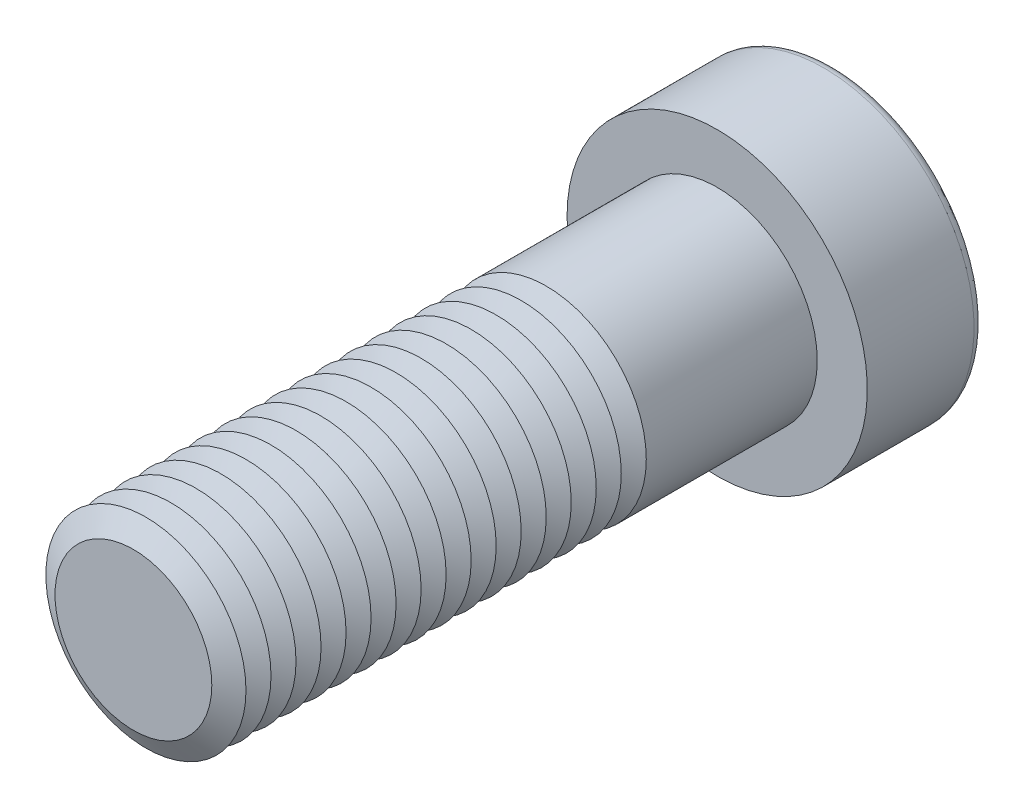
ISO-10303-21;
HEADER;
FILE_DESCRIPTION(('STEP AP214'),'2;1');
FILE_NAME('part.step','',(''),(''),'','','');
FILE_SCHEMA(('AUTOMOTIVE_DESIGN { 1 0 10303 214 1 1 1 1 }'));
ENDSEC;
DATA;
#1=APPLICATION_CONTEXT('core data for automotive mechanical design processes');
#2=APPLICATION_PROTOCOL_DEFINITION('international standard','automotive_design',2000,#1);
#3=PRODUCT_CONTEXT('',#1,'mechanical');
#4=PRODUCT('Part','Part','',(#3));
#5=PRODUCT_RELATED_PRODUCT_CATEGORY('part','',(#4));
#6=PRODUCT_DEFINITION_FORMATION('','',#4);
#7=PRODUCT_DEFINITION_CONTEXT('part definition',#1,'design');
#8=PRODUCT_DEFINITION('design','',#6,#7);
#9=PRODUCT_DEFINITION_SHAPE('','',#8);
#10=(LENGTH_UNIT() NAMED_UNIT(*) SI_UNIT(.MILLI.,.METRE.));
#11=(NAMED_UNIT(*) PLANE_ANGLE_UNIT() SI_UNIT($,.RADIAN.));
#12=(NAMED_UNIT(*) SI_UNIT($,.STERADIAN.) SOLID_ANGLE_UNIT());
#13=UNCERTAINTY_MEASURE_WITH_UNIT(LENGTH_MEASURE(1.E-05),#10,'distance_accuracy_value','');
#14=(GEOMETRIC_REPRESENTATION_CONTEXT(3) GLOBAL_UNCERTAINTY_ASSIGNED_CONTEXT((#13)) GLOBAL_UNIT_ASSIGNED_CONTEXT((#10,
#11,#12)) REPRESENTATION_CONTEXT('',''));
#15=CARTESIAN_POINT('',(0.,0.,0.));
#16=DIRECTION('',(0.,0.,1.));
#17=DIRECTION('',(1.,0.,0.));
#18=AXIS2_PLACEMENT_3D('',#15,#16,#17);
#19=CARTESIAN_POINT('',(0.,0.,59.5));
#20=DIRECTION('',(0.,0.,1.));
#21=DIRECTION('',(1.,0.,0.));
#22=AXIS2_PLACEMENT_3D('',#19,#20,#21);
#23=CONICAL_SURFACE('',#22,12.,1.0471975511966);
#24=CARTESIAN_POINT('',(0.,0.,58.));
#25=DIRECTION('',(0.,0.,1.));
#26=DIRECTION('',(1.,0.,0.));
#27=AXIS2_PLACEMENT_3D('',#24,#25,#26);
#28=CIRCLE('',#27,9.40192378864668);
#29=CARTESIAN_POINT('',(9.40192378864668,0.,58.));
#30=VERTEX_POINT('',#29);
#31=EDGE_CURVE('E314',#30,#30,#28,.T.);
#32=ORIENTED_EDGE('',*,*,#31,.T.);
#33=EDGE_LOOP('',(#32));
#34=FACE_BOUND('',#33,.T.);
#35=CARTESIAN_POINT('',(0.,0.,59.5));
#36=DIRECTION('',(0.,0.,1.));
#37=DIRECTION('',(1.,0.,0.));
#38=AXIS2_PLACEMENT_3D('',#35,#36,#37);
#39=CIRCLE('',#38,12.);
#40=CARTESIAN_POINT('',(12.,0.,59.5));
#41=VERTEX_POINT('',#40);
#42=EDGE_CURVE('E317',#41,#41,#39,.T.);
#43=ORIENTED_EDGE('',*,*,#42,.F.);
#44=EDGE_LOOP('',(#43));
#45=FACE_BOUND('',#44,.T.);
#46=ADVANCED_FACE('F39',(#34,#45),#23,.T.);
#47=CARTESIAN_POINT('',(0.,0.,58.));
#48=DIRECTION('',(0.,0.,-1.));
#49=DIRECTION('',(-1.,0.,0.));
#50=AXIS2_PLACEMENT_3D('',#47,#48,#49);
#51=CONICAL_SURFACE('',#50,9.40192378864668,1.0471975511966);
#52=CARTESIAN_POINT('',(0.,0.,56.5));
#53=DIRECTION('',(0.,0.,1.));
#54=DIRECTION('',(1.,0.,0.));
#55=AXIS2_PLACEMENT_3D('',#52,#53,#54);
#56=CIRCLE('',#55,12.);
#57=CARTESIAN_POINT('',(12.,0.,56.5));
#58=VERTEX_POINT('',#57);
#59=EDGE_CURVE('E325',#58,#58,#56,.T.);
#60=ORIENTED_EDGE('',*,*,#59,.T.);
#61=EDGE_LOOP('',(#60));
#62=FACE_BOUND('',#61,.T.);
#63=ORIENTED_EDGE('',*,*,#31,.F.);
#64=EDGE_LOOP('',(#63));
#65=FACE_BOUND('',#64,.T.);
#66=ADVANCED_FACE('F245',(#62,#65),#51,.T.);
#67=CARTESIAN_POINT('',(0.,0.,70.));
#68=DIRECTION('',(0.,0.,1.));
#69=DIRECTION('',(1.,0.,0.));
#70=AXIS2_PLACEMENT_3D('',#67,#68,#69);
#71=PLANE('',#70);
#72=CARTESIAN_POINT('',(0.,0.,70.));
#73=DIRECTION('',(0.,0.,1.));
#74=DIRECTION('',(1.,0.,0.));
#75=AXIS2_PLACEMENT_3D('',#72,#73,#74);
#76=CIRCLE('',#75,9.40192378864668);
#77=CARTESIAN_POINT('',(9.40192378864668,0.,70.));
#78=VERTEX_POINT('',#77);
#79=EDGE_CURVE('E174',#78,#78,#76,.T.);
#80=ORIENTED_EDGE('',*,*,#79,.T.);
#81=EDGE_LOOP('',(#80));
#82=FACE_BOUND('',#81,.T.);
#83=ADVANCED_FACE('F251',(#82),#71,.T.);
#84=CARTESIAN_POINT('',(0.,0.,70.));
#85=DIRECTION('',(0.,0.,-1.));
#86=DIRECTION('',(-1.,0.,0.));
#87=AXIS2_PLACEMENT_3D('',#84,#85,#86);
#88=CONICAL_SURFACE('',#87,9.40192378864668,1.0471975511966);
#89=CARTESIAN_POINT('',(0.,0.,68.5));
#90=DIRECTION('',(0.,0.,1.));
#91=DIRECTION('',(1.,0.,0.));
#92=AXIS2_PLACEMENT_3D('',#89,#90,#91);
#93=CIRCLE('',#92,12.);
#94=CARTESIAN_POINT('',(12.,0.,68.5));
#95=VERTEX_POINT('',#94);
#96=EDGE_CURVE('E291',#95,#95,#93,.T.);
#97=ORIENTED_EDGE('',*,*,#96,.T.);
#98=EDGE_LOOP('',(#97));
#99=FACE_BOUND('',#98,.T.);
#100=ORIENTED_EDGE('',*,*,#79,.F.);
#101=EDGE_LOOP('',(#100));
#102=FACE_BOUND('',#101,.T.);
#103=ADVANCED_FACE('F199',(#99,#102),#88,.T.);
#104=CARTESIAN_POINT('',(0.,0.,68.5));
#105=DIRECTION('',(0.,0.,1.));
#106=DIRECTION('',(1.,0.,0.));
#107=AXIS2_PLACEMENT_3D('',#104,#105,#106);
#108=CONICAL_SURFACE('',#107,12.,1.0471975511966);
#109=CARTESIAN_POINT('',(0.,0.,67.));
#110=DIRECTION('',(0.,0.,1.));
#111=DIRECTION('',(1.,0.,0.));
#112=AXIS2_PLACEMENT_3D('',#109,#110,#111);
#113=CIRCLE('',#112,9.40192378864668);
#114=CARTESIAN_POINT('',(9.40192378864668,0.,67.));
#115=VERTEX_POINT('',#114);
#116=EDGE_CURVE('E288',#115,#115,#113,.T.);
#117=ORIENTED_EDGE('',*,*,#116,.T.);
#118=EDGE_LOOP('',(#117));
#119=FACE_BOUND('',#118,.T.);
#120=ORIENTED_EDGE('',*,*,#96,.F.);
#121=EDGE_LOOP('',(#120));
#122=FACE_BOUND('',#121,.T.);
#123=ADVANCED_FACE('F277',(#119,#122),#108,.T.);
#124=CARTESIAN_POINT('',(0.,0.,67.));
#125=DIRECTION('',(0.,0.,-1.));
#126=DIRECTION('',(-1.,0.,0.));
#127=AXIS2_PLACEMENT_3D('',#124,#125,#126);
#128=CONICAL_SURFACE('',#127,9.40192378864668,1.0471975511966);
#129=CARTESIAN_POINT('',(0.,0.,65.5));
#130=DIRECTION('',(0.,0.,1.));
#131=DIRECTION('',(1.,0.,0.));
#132=AXIS2_PLACEMENT_3D('',#129,#130,#131);
#133=CIRCLE('',#132,12.);
#134=CARTESIAN_POINT('',(12.,0.,65.5));
#135=VERTEX_POINT('',#134);
#136=EDGE_CURVE('E300',#135,#135,#133,.T.);
#137=ORIENTED_EDGE('',*,*,#136,.T.);
#138=EDGE_LOOP('',(#137));
#139=FACE_BOUND('',#138,.T.);
#140=ORIENTED_EDGE('',*,*,#116,.F.);
#141=EDGE_LOOP('',(#140));
#142=FACE_BOUND('',#141,.T.);
#143=ADVANCED_FACE('F274',(#139,#142),#128,.T.);
#144=CARTESIAN_POINT('',(0.,0.,65.5));
#145=DIRECTION('',(0.,0.,1.));
#146=DIRECTION('',(1.,0.,0.));
#147=AXIS2_PLACEMENT_3D('',#144,#145,#146);
#148=CONICAL_SURFACE('',#147,12.,1.0471975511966);
#149=CARTESIAN_POINT('',(0.,0.,64.));
#150=DIRECTION('',(0.,0.,1.));
#151=DIRECTION('',(1.,0.,0.));
#152=AXIS2_PLACEMENT_3D('',#149,#150,#151);
#153=CIRCLE('',#152,9.40192378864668);
#154=CARTESIAN_POINT('',(9.40192378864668,0.,64.));
#155=VERTEX_POINT('',#154);
#156=EDGE_CURVE('E293',#155,#155,#153,.T.);
#157=ORIENTED_EDGE('',*,*,#156,.T.);
#158=EDGE_LOOP('',(#157));
#159=FACE_BOUND('',#158,.T.);
#160=ORIENTED_EDGE('',*,*,#136,.F.);
#161=EDGE_LOOP('',(#160));
#162=FACE_BOUND('',#161,.T.);
#163=ADVANCED_FACE('F270',(#159,#162),#148,.T.);
#164=CARTESIAN_POINT('',(0.,0.,64.));
#165=DIRECTION('',(0.,0.,-1.));
#166=DIRECTION('',(-1.,0.,0.));
#167=AXIS2_PLACEMENT_3D('',#164,#165,#166);
#168=CONICAL_SURFACE('',#167,9.40192378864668,1.0471975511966);
#169=CARTESIAN_POINT('',(0.,0.,62.5));
#170=DIRECTION('',(0.,0.,1.));
#171=DIRECTION('',(1.,0.,0.));
#172=AXIS2_PLACEMENT_3D('',#169,#170,#171);
#173=CIRCLE('',#172,12.);
#174=CARTESIAN_POINT('',(12.,0.,62.5));
#175=VERTEX_POINT('',#174);
#176=EDGE_CURVE('E310',#175,#175,#173,.T.);
#177=ORIENTED_EDGE('',*,*,#176,.T.);
#178=EDGE_LOOP('',(#177));
#179=FACE_BOUND('',#178,.T.);
#180=ORIENTED_EDGE('',*,*,#156,.F.);
#181=EDGE_LOOP('',(#180));
#182=FACE_BOUND('',#181,.T.);
#183=ADVANCED_FACE('F266',(#179,#182),#168,.T.);
#184=CARTESIAN_POINT('',(0.,0.,62.5));
#185=DIRECTION('',(0.,0.,1.));
#186=DIRECTION('',(1.,0.,0.));
#187=AXIS2_PLACEMENT_3D('',#184,#185,#186);
#188=CONICAL_SURFACE('',#187,12.,1.0471975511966);
#189=CARTESIAN_POINT('',(0.,0.,61.));
#190=DIRECTION('',(0.,0.,1.));
#191=DIRECTION('',(1.,0.,0.));
#192=AXIS2_PLACEMENT_3D('',#189,#190,#191);
#193=CIRCLE('',#192,9.40192378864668);
#194=CARTESIAN_POINT('',(9.40192378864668,0.,61.));
#195=VERTEX_POINT('',#194);
#196=EDGE_CURVE('E306',#195,#195,#193,.T.);
#197=ORIENTED_EDGE('',*,*,#196,.T.);
#198=EDGE_LOOP('',(#197));
#199=FACE_BOUND('',#198,.T.);
#200=ORIENTED_EDGE('',*,*,#176,.F.);
#201=EDGE_LOOP('',(#200));
#202=FACE_BOUND('',#201,.T.);
#203=ADVANCED_FACE('F262',(#199,#202),#188,.T.);
#204=CARTESIAN_POINT('',(0.,0.,61.));
#205=DIRECTION('',(0.,0.,-1.));
#206=DIRECTION('',(-1.,0.,0.));
#207=AXIS2_PLACEMENT_3D('',#204,#205,#206);
#208=CONICAL_SURFACE('',#207,9.40192378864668,1.0471975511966);
#209=ORIENTED_EDGE('',*,*,#42,.T.);
#210=EDGE_LOOP('',(#209));
#211=FACE_BOUND('',#210,.T.);
#212=ORIENTED_EDGE('',*,*,#196,.F.);
#213=EDGE_LOOP('',(#212));
#214=FACE_BOUND('',#213,.T.);
#215=ADVANCED_FACE('F258',(#211,#214),#208,.T.);
#216=CARTESIAN_POINT('',(0.,0.,56.5));
#217=DIRECTION('',(0.,0.,1.));
#218=DIRECTION('',(1.,0.,0.));
#219=AXIS2_PLACEMENT_3D('',#216,#217,#218);
#220=CONICAL_SURFACE('',#219,12.,1.0471975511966);
#221=CARTESIAN_POINT('',(0.,0.,55.));
#222=DIRECTION('',(0.,0.,1.));
#223=DIRECTION('',(1.,0.,0.));
#224=AXIS2_PLACEMENT_3D('',#221,#222,#223);
#225=CIRCLE('',#224,9.40192378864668);
#226=CARTESIAN_POINT('',(9.40192378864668,0.,55.));
#227=VERTEX_POINT('',#226);
#228=EDGE_CURVE('E321',#227,#227,#225,.T.);
#229=ORIENTED_EDGE('',*,*,#228,.T.);
#230=EDGE_LOOP('',(#229));
#231=FACE_BOUND('',#230,.T.);
#232=ORIENTED_EDGE('',*,*,#59,.F.);
#233=EDGE_LOOP('',(#232));
#234=FACE_BOUND('',#233,.T.);
#235=ADVANCED_FACE('F261',(#231,#234),#220,.T.);
#236=CARTESIAN_POINT('',(0.,0.,55.));
#237=DIRECTION('',(0.,0.,-1.));
#238=DIRECTION('',(-1.,0.,0.));
#239=AXIS2_PLACEMENT_3D('',#236,#237,#238);
#240=CONICAL_SURFACE('',#239,9.40192378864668,1.0471975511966);
#241=CARTESIAN_POINT('',(0.,0.,53.5));
#242=DIRECTION('',(0.,0.,1.));
#243=DIRECTION('',(1.,0.,0.));
#244=AXIS2_PLACEMENT_3D('',#241,#242,#243);
#245=CIRCLE('',#244,12.);
#246=CARTESIAN_POINT('',(12.,0.,53.5));
#247=VERTEX_POINT('',#246);
#248=EDGE_CURVE('E332',#247,#247,#245,.T.);
#249=ORIENTED_EDGE('',*,*,#248,.T.);
#250=EDGE_LOOP('',(#249));
#251=FACE_BOUND('',#250,.T.);
#252=ORIENTED_EDGE('',*,*,#228,.F.);
#253=EDGE_LOOP('',(#252));
#254=FACE_BOUND('',#253,.T.);
#255=ADVANCED_FACE('F512',(#251,#254),#240,.T.);
#256=CARTESIAN_POINT('',(0.,0.,53.5));
#257=DIRECTION('',(0.,0.,1.));
#258=DIRECTION('',(1.,0.,0.));
#259=AXIS2_PLACEMENT_3D('',#256,#257,#258);
#260=CONICAL_SURFACE('',#259,12.,1.0471975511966);
#261=CARTESIAN_POINT('',(0.,0.,52.));
#262=DIRECTION('',(0.,0.,1.));
#263=DIRECTION('',(1.,0.,0.));
#264=AXIS2_PLACEMENT_3D('',#261,#262,#263);
#265=CIRCLE('',#264,9.40192378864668);
#266=CARTESIAN_POINT('',(9.40192378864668,0.,52.));
#267=VERTEX_POINT('',#266);
#268=EDGE_CURVE('E329',#267,#267,#265,.T.);
#269=ORIENTED_EDGE('',*,*,#268,.T.);
#270=EDGE_LOOP('',(#269));
#271=FACE_BOUND('',#270,.T.);
#272=ORIENTED_EDGE('',*,*,#248,.F.);
#273=EDGE_LOOP('',(#272));
#274=FACE_BOUND('',#273,.T.);
#275=ADVANCED_FACE('F508',(#271,#274),#260,.T.);
#276=CARTESIAN_POINT('',(0.,0.,52.));
#277=DIRECTION('',(0.,0.,-1.));
#278=DIRECTION('',(-1.,0.,0.));
#279=AXIS2_PLACEMENT_3D('',#276,#277,#278);
#280=CONICAL_SURFACE('',#279,9.40192378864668,1.0471975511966);
#281=CARTESIAN_POINT('',(0.,0.,50.5));
#282=DIRECTION('',(0.,0.,1.));
#283=DIRECTION('',(1.,0.,0.));
#284=AXIS2_PLACEMENT_3D('',#281,#282,#283);
#285=CIRCLE('',#284,12.);
#286=CARTESIAN_POINT('',(12.,0.,50.5));
#287=VERTEX_POINT('',#286);
#288=EDGE_CURVE('E340',#287,#287,#285,.T.);
#289=ORIENTED_EDGE('',*,*,#288,.T.);
#290=EDGE_LOOP('',(#289));
#291=FACE_BOUND('',#290,.T.);
#292=ORIENTED_EDGE('',*,*,#268,.F.);
#293=EDGE_LOOP('',(#292));
#294=FACE_BOUND('',#293,.T.);
#295=ADVANCED_FACE('F504',(#291,#294),#280,.T.);
#296=CARTESIAN_POINT('',(0.,0.,50.5));
#297=DIRECTION('',(0.,0.,1.));
#298=DIRECTION('',(1.,0.,0.));
#299=AXIS2_PLACEMENT_3D('',#296,#297,#298);
#300=CONICAL_SURFACE('',#299,12.,1.0471975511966);
#301=CARTESIAN_POINT('',(0.,0.,49.));
#302=DIRECTION('',(0.,0.,1.));
#303=DIRECTION('',(1.,0.,0.));
#304=AXIS2_PLACEMENT_3D('',#301,#302,#303);
#305=CIRCLE('',#304,9.40192378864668);
#306=CARTESIAN_POINT('',(9.40192378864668,0.,49.));
#307=VERTEX_POINT('',#306);
#308=EDGE_CURVE('E336',#307,#307,#305,.T.);
#309=ORIENTED_EDGE('',*,*,#308,.T.);
#310=EDGE_LOOP('',(#309));
#311=FACE_BOUND('',#310,.T.);
#312=ORIENTED_EDGE('',*,*,#288,.F.);
#313=EDGE_LOOP('',(#312));
#314=FACE_BOUND('',#313,.T.);
#315=ADVANCED_FACE('F500',(#311,#314),#300,.T.);
#316=CARTESIAN_POINT('',(0.,0.,49.));
#317=DIRECTION('',(0.,0.,-1.));
#318=DIRECTION('',(-1.,0.,0.));
#319=AXIS2_PLACEMENT_3D('',#316,#317,#318);
#320=CONICAL_SURFACE('',#319,9.40192378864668,1.0471975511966);
#321=CARTESIAN_POINT('',(0.,0.,47.5));
#322=DIRECTION('',(0.,0.,1.));
#323=DIRECTION('',(1.,0.,0.));
#324=AXIS2_PLACEMENT_3D('',#321,#322,#323);
#325=CIRCLE('',#324,12.);
#326=CARTESIAN_POINT('',(12.,0.,47.5));
#327=VERTEX_POINT('',#326);
#328=EDGE_CURVE('E347',#327,#327,#325,.T.);
#329=ORIENTED_EDGE('',*,*,#328,.T.);
#330=EDGE_LOOP('',(#329));
#331=FACE_BOUND('',#330,.T.);
#332=ORIENTED_EDGE('',*,*,#308,.F.);
#333=EDGE_LOOP('',(#332));
#334=FACE_BOUND('',#333,.T.);
#335=ADVANCED_FACE('F496',(#331,#334),#320,.T.);
#336=CARTESIAN_POINT('',(0.,0.,47.5));
#337=DIRECTION('',(0.,0.,1.));
#338=DIRECTION('',(1.,0.,0.));
#339=AXIS2_PLACEMENT_3D('',#336,#337,#338);
#340=CONICAL_SURFACE('',#339,12.,1.0471975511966);
#341=CARTESIAN_POINT('',(0.,0.,46.));
#342=DIRECTION('',(0.,0.,1.));
#343=DIRECTION('',(1.,0.,0.));
#344=AXIS2_PLACEMENT_3D('',#341,#342,#343);
#345=CIRCLE('',#344,9.40192378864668);
#346=CARTESIAN_POINT('',(9.40192378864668,0.,46.));
#347=VERTEX_POINT('',#346);
#348=EDGE_CURVE('E344',#347,#347,#345,.T.);
#349=ORIENTED_EDGE('',*,*,#348,.T.);
#350=EDGE_LOOP('',(#349));
#351=FACE_BOUND('',#350,.T.);
#352=ORIENTED_EDGE('',*,*,#328,.F.);
#353=EDGE_LOOP('',(#352));
#354=FACE_BOUND('',#353,.T.);
#355=ADVANCED_FACE('F492',(#351,#354),#340,.T.);
#356=CARTESIAN_POINT('',(0.,0.,46.));
#357=DIRECTION('',(0.,0.,-1.));
#358=DIRECTION('',(-1.,0.,0.));
#359=AXIS2_PLACEMENT_3D('',#356,#357,#358);
#360=CONICAL_SURFACE('',#359,9.40192378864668,1.0471975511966);
#361=CARTESIAN_POINT('',(0.,0.,44.5));
#362=DIRECTION('',(0.,0.,1.));
#363=DIRECTION('',(1.,0.,0.));
#364=AXIS2_PLACEMENT_3D('',#361,#362,#363);
#365=CIRCLE('',#364,12.);
#366=CARTESIAN_POINT('',(12.,0.,44.5));
#367=VERTEX_POINT('',#366);
#368=EDGE_CURVE('E355',#367,#367,#365,.T.);
#369=ORIENTED_EDGE('',*,*,#368,.T.);
#370=EDGE_LOOP('',(#369));
#371=FACE_BOUND('',#370,.T.);
#372=ORIENTED_EDGE('',*,*,#348,.F.);
#373=EDGE_LOOP('',(#372));
#374=FACE_BOUND('',#373,.T.);
#375=ADVANCED_FACE('F488',(#371,#374),#360,.T.);
#376=CARTESIAN_POINT('',(0.,0.,44.5));
#377=DIRECTION('',(0.,0.,1.));
#378=DIRECTION('',(1.,0.,0.));
#379=AXIS2_PLACEMENT_3D('',#376,#377,#378);
#380=CONICAL_SURFACE('',#379,12.,1.0471975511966);
#381=CARTESIAN_POINT('',(0.,0.,43.));
#382=DIRECTION('',(0.,0.,1.));
#383=DIRECTION('',(1.,0.,0.));
#384=AXIS2_PLACEMENT_3D('',#381,#382,#383);
#385=CIRCLE('',#384,9.40192378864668);
#386=CARTESIAN_POINT('',(9.40192378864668,0.,43.));
#387=VERTEX_POINT('',#386);
#388=EDGE_CURVE('E351',#387,#387,#385,.T.);
#389=ORIENTED_EDGE('',*,*,#388,.T.);
#390=EDGE_LOOP('',(#389));
#391=FACE_BOUND('',#390,.T.);
#392=ORIENTED_EDGE('',*,*,#368,.F.);
#393=EDGE_LOOP('',(#392));
#394=FACE_BOUND('',#393,.T.);
#395=ADVANCED_FACE('F484',(#391,#394),#380,.T.);
#396=CARTESIAN_POINT('',(0.,0.,43.));
#397=DIRECTION('',(0.,0.,-1.));
#398=DIRECTION('',(-1.,0.,0.));
#399=AXIS2_PLACEMENT_3D('',#396,#397,#398);
#400=CONICAL_SURFACE('',#399,9.40192378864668,1.0471975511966);
#401=CARTESIAN_POINT('',(0.,0.,41.5));
#402=DIRECTION('',(0.,0.,1.));
#403=DIRECTION('',(1.,0.,0.));
#404=AXIS2_PLACEMENT_3D('',#401,#402,#403);
#405=CIRCLE('',#404,12.);
#406=CARTESIAN_POINT('',(12.,0.,41.5));
#407=VERTEX_POINT('',#406);
#408=EDGE_CURVE('E363',#407,#407,#405,.T.);
#409=ORIENTED_EDGE('',*,*,#408,.T.);
#410=EDGE_LOOP('',(#409));
#411=FACE_BOUND('',#410,.T.);
#412=ORIENTED_EDGE('',*,*,#388,.F.);
#413=EDGE_LOOP('',(#412));
#414=FACE_BOUND('',#413,.T.);
#415=ADVANCED_FACE('F480',(#411,#414),#400,.T.);
#416=CARTESIAN_POINT('',(0.,0.,41.5));
#417=DIRECTION('',(0.,0.,1.));
#418=DIRECTION('',(1.,0.,0.));
#419=AXIS2_PLACEMENT_3D('',#416,#417,#418);
#420=CONICAL_SURFACE('',#419,12.,1.0471975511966);
#421=CARTESIAN_POINT('',(0.,0.,40.));
#422=DIRECTION('',(0.,0.,1.));
#423=DIRECTION('',(1.,0.,0.));
#424=AXIS2_PLACEMENT_3D('',#421,#422,#423);
#425=CIRCLE('',#424,9.40192378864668);
#426=CARTESIAN_POINT('',(9.40192378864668,0.,40.));
#427=VERTEX_POINT('',#426);
#428=EDGE_CURVE('E359',#427,#427,#425,.T.);
#429=ORIENTED_EDGE('',*,*,#428,.T.);
#430=EDGE_LOOP('',(#429));
#431=FACE_BOUND('',#430,.T.);
#432=ORIENTED_EDGE('',*,*,#408,.F.);
#433=EDGE_LOOP('',(#432));
#434=FACE_BOUND('',#433,.T.);
#435=ADVANCED_FACE('F476',(#431,#434),#420,.T.);
#436=CARTESIAN_POINT('',(0.,0.,40.));
#437=DIRECTION('',(0.,0.,-1.));
#438=DIRECTION('',(-1.,0.,0.));
#439=AXIS2_PLACEMENT_3D('',#436,#437,#438);
#440=CONICAL_SURFACE('',#439,9.40192378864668,1.0471975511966);
#441=CARTESIAN_POINT('',(0.,0.,38.5));
#442=DIRECTION('',(0.,0.,1.));
#443=DIRECTION('',(1.,0.,0.));
#444=AXIS2_PLACEMENT_3D('',#441,#442,#443);
#445=CIRCLE('',#444,12.);
#446=CARTESIAN_POINT('',(12.,0.,38.5));
#447=VERTEX_POINT('',#446);
#448=EDGE_CURVE('E371',#447,#447,#445,.T.);
#449=ORIENTED_EDGE('',*,*,#448,.T.);
#450=EDGE_LOOP('',(#449));
#451=FACE_BOUND('',#450,.T.);
#452=ORIENTED_EDGE('',*,*,#428,.F.);
#453=EDGE_LOOP('',(#452));
#454=FACE_BOUND('',#453,.T.);
#455=ADVANCED_FACE('F472',(#451,#454),#440,.T.);
#456=CARTESIAN_POINT('',(0.,0.,38.5));
#457=DIRECTION('',(0.,0.,1.));
#458=DIRECTION('',(1.,0.,0.));
#459=AXIS2_PLACEMENT_3D('',#456,#457,#458);
#460=CONICAL_SURFACE('',#459,12.,1.0471975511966);
#461=CARTESIAN_POINT('',(0.,0.,37.));
#462=DIRECTION('',(0.,0.,1.));
#463=DIRECTION('',(1.,0.,0.));
#464=AXIS2_PLACEMENT_3D('',#461,#462,#463);
#465=CIRCLE('',#464,9.40192378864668);
#466=CARTESIAN_POINT('',(9.40192378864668,0.,37.));
#467=VERTEX_POINT('',#466);
#468=EDGE_CURVE('E367',#467,#467,#465,.T.);
#469=ORIENTED_EDGE('',*,*,#468,.T.);
#470=EDGE_LOOP('',(#469));
#471=FACE_BOUND('',#470,.T.);
#472=ORIENTED_EDGE('',*,*,#448,.F.);
#473=EDGE_LOOP('',(#472));
#474=FACE_BOUND('',#473,.T.);
#475=ADVANCED_FACE('F468',(#471,#474),#460,.T.);
#476=CARTESIAN_POINT('',(0.,0.,37.));
#477=DIRECTION('',(0.,0.,-1.));
#478=DIRECTION('',(-1.,0.,0.));
#479=AXIS2_PLACEMENT_3D('',#476,#477,#478);
#480=CONICAL_SURFACE('',#479,9.40192378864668,1.0471975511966);
#481=CARTESIAN_POINT('',(0.,0.,35.5));
#482=DIRECTION('',(0.,0.,1.));
#483=DIRECTION('',(1.,0.,0.));
#484=AXIS2_PLACEMENT_3D('',#481,#482,#483);
#485=CIRCLE('',#484,12.);
#486=CARTESIAN_POINT('',(12.,0.,35.5));
#487=VERTEX_POINT('',#486);
#488=EDGE_CURVE('E379',#487,#487,#485,.T.);
#489=ORIENTED_EDGE('',*,*,#488,.T.);
#490=EDGE_LOOP('',(#489));
#491=FACE_BOUND('',#490,.T.);
#492=ORIENTED_EDGE('',*,*,#468,.F.);
#493=EDGE_LOOP('',(#492));
#494=FACE_BOUND('',#493,.T.);
#495=ADVANCED_FACE('F464',(#491,#494),#480,.T.);
#496=CARTESIAN_POINT('',(0.,0.,35.5));
#497=DIRECTION('',(0.,0.,1.));
#498=DIRECTION('',(1.,0.,0.));
#499=AXIS2_PLACEMENT_3D('',#496,#497,#498);
#500=CONICAL_SURFACE('',#499,12.,1.0471975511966);
#501=CARTESIAN_POINT('',(0.,0.,34.));
#502=DIRECTION('',(0.,0.,1.));
#503=DIRECTION('',(1.,0.,0.));
#504=AXIS2_PLACEMENT_3D('',#501,#502,#503);
#505=CIRCLE('',#504,9.40192378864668);
#506=CARTESIAN_POINT('',(9.40192378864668,0.,34.));
#507=VERTEX_POINT('',#506);
#508=EDGE_CURVE('E375',#507,#507,#505,.T.);
#509=ORIENTED_EDGE('',*,*,#508,.T.);
#510=EDGE_LOOP('',(#509));
#511=FACE_BOUND('',#510,.T.);
#512=ORIENTED_EDGE('',*,*,#488,.F.);
#513=EDGE_LOOP('',(#512));
#514=FACE_BOUND('',#513,.T.);
#515=ADVANCED_FACE('F460',(#511,#514),#500,.T.);
#516=CARTESIAN_POINT('',(0.,0.,34.));
#517=DIRECTION('',(0.,0.,-1.));
#518=DIRECTION('',(-1.,0.,0.));
#519=AXIS2_PLACEMENT_3D('',#516,#517,#518);
#520=CONICAL_SURFACE('',#519,9.40192378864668,1.0471975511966);
#521=CARTESIAN_POINT('',(0.,0.,32.5));
#522=DIRECTION('',(0.,0.,1.));
#523=DIRECTION('',(1.,0.,0.));
#524=AXIS2_PLACEMENT_3D('',#521,#522,#523);
#525=CIRCLE('',#524,12.);
#526=CARTESIAN_POINT('',(12.,0.,32.5));
#527=VERTEX_POINT('',#526);
#528=EDGE_CURVE('E387',#527,#527,#525,.T.);
#529=ORIENTED_EDGE('',*,*,#528,.T.);
#530=EDGE_LOOP('',(#529));
#531=FACE_BOUND('',#530,.T.);
#532=ORIENTED_EDGE('',*,*,#508,.F.);
#533=EDGE_LOOP('',(#532));
#534=FACE_BOUND('',#533,.T.);
#535=ADVANCED_FACE('F456',(#531,#534),#520,.T.);
#536=CARTESIAN_POINT('',(0.,0.,32.5));
#537=DIRECTION('',(0.,0.,1.));
#538=DIRECTION('',(1.,0.,0.));
#539=AXIS2_PLACEMENT_3D('',#536,#537,#538);
#540=CONICAL_SURFACE('',#539,12.,1.0471975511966);
#541=CARTESIAN_POINT('',(0.,0.,31.));
#542=DIRECTION('',(0.,0.,1.));
#543=DIRECTION('',(1.,0.,0.));
#544=AXIS2_PLACEMENT_3D('',#541,#542,#543);
#545=CIRCLE('',#544,9.40192378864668);
#546=CARTESIAN_POINT('',(9.40192378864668,0.,31.));
#547=VERTEX_POINT('',#546);
#548=EDGE_CURVE('E383',#547,#547,#545,.T.);
#549=ORIENTED_EDGE('',*,*,#548,.T.);
#550=EDGE_LOOP('',(#549));
#551=FACE_BOUND('',#550,.T.);
#552=ORIENTED_EDGE('',*,*,#528,.F.);
#553=EDGE_LOOP('',(#552));
#554=FACE_BOUND('',#553,.T.);
#555=ADVANCED_FACE('F452',(#551,#554),#540,.T.);
#556=CARTESIAN_POINT('',(0.,0.,31.));
#557=DIRECTION('',(0.,0.,-1.));
#558=DIRECTION('',(-1.,0.,0.));
#559=AXIS2_PLACEMENT_3D('',#556,#557,#558);
#560=CONICAL_SURFACE('',#559,9.40192378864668,1.0471975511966);
#561=CARTESIAN_POINT('',(0.,0.,29.5));
#562=DIRECTION('',(0.,0.,1.));
#563=DIRECTION('',(1.,0.,0.));
#564=AXIS2_PLACEMENT_3D('',#561,#562,#563);
#565=CIRCLE('',#564,12.);
#566=CARTESIAN_POINT('',(12.,0.,29.5));
#567=VERTEX_POINT('',#566);
#568=EDGE_CURVE('E395',#567,#567,#565,.T.);
#569=ORIENTED_EDGE('',*,*,#568,.T.);
#570=EDGE_LOOP('',(#569));
#571=FACE_BOUND('',#570,.T.);
#572=ORIENTED_EDGE('',*,*,#548,.F.);
#573=EDGE_LOOP('',(#572));
#574=FACE_BOUND('',#573,.T.);
#575=ADVANCED_FACE('F448',(#571,#574),#560,.T.);
#576=CARTESIAN_POINT('',(0.,0.,29.5));
#577=DIRECTION('',(0.,0.,1.));
#578=DIRECTION('',(1.,0.,0.));
#579=AXIS2_PLACEMENT_3D('',#576,#577,#578);
#580=CONICAL_SURFACE('',#579,12.,1.0471975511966);
#581=CARTESIAN_POINT('',(0.,0.,28.));
#582=DIRECTION('',(0.,0.,1.));
#583=DIRECTION('',(1.,0.,0.));
#584=AXIS2_PLACEMENT_3D('',#581,#582,#583);
#585=CIRCLE('',#584,9.40192378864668);
#586=CARTESIAN_POINT('',(9.40192378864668,0.,28.));
#587=VERTEX_POINT('',#586);
#588=EDGE_CURVE('E391',#587,#587,#585,.T.);
#589=ORIENTED_EDGE('',*,*,#588,.T.);
#590=EDGE_LOOP('',(#589));
#591=FACE_BOUND('',#590,.T.);
#592=ORIENTED_EDGE('',*,*,#568,.F.);
#593=EDGE_LOOP('',(#592));
#594=FACE_BOUND('',#593,.T.);
#595=ADVANCED_FACE('F444',(#591,#594),#580,.T.);
#596=CARTESIAN_POINT('',(0.,0.,28.));
#597=DIRECTION('',(0.,0.,-1.));
#598=DIRECTION('',(-1.,0.,0.));
#599=AXIS2_PLACEMENT_3D('',#596,#597,#598);
#600=CONICAL_SURFACE('',#599,9.40192378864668,1.0471975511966);
#601=CARTESIAN_POINT('',(0.,0.,26.5));
#602=DIRECTION('',(0.,0.,1.));
#603=DIRECTION('',(1.,0.,0.));
#604=AXIS2_PLACEMENT_3D('',#601,#602,#603);
#605=CIRCLE('',#604,12.);
#606=CARTESIAN_POINT('',(12.,0.,26.5));
#607=VERTEX_POINT('',#606);
#608=EDGE_CURVE('E403',#607,#607,#605,.T.);
#609=ORIENTED_EDGE('',*,*,#608,.T.);
#610=EDGE_LOOP('',(#609));
#611=FACE_BOUND('',#610,.T.);
#612=ORIENTED_EDGE('',*,*,#588,.F.);
#613=EDGE_LOOP('',(#612));
#614=FACE_BOUND('',#613,.T.);
#615=ADVANCED_FACE('F440',(#611,#614),#600,.T.);
#616=CARTESIAN_POINT('',(0.,0.,26.5));
#617=DIRECTION('',(0.,0.,1.));
#618=DIRECTION('',(1.,0.,0.));
#619=AXIS2_PLACEMENT_3D('',#616,#617,#618);
#620=CONICAL_SURFACE('',#619,12.,1.0471975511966);
#621=CARTESIAN_POINT('',(0.,0.,25.));
#622=DIRECTION('',(0.,0.,1.));
#623=DIRECTION('',(1.,0.,0.));
#624=AXIS2_PLACEMENT_3D('',#621,#622,#623);
#625=CIRCLE('',#624,9.40192378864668);
#626=CARTESIAN_POINT('',(9.40192378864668,0.,25.));
#627=VERTEX_POINT('',#626);
#628=EDGE_CURVE('E399',#627,#627,#625,.T.);
#629=ORIENTED_EDGE('',*,*,#628,.T.);
#630=EDGE_LOOP('',(#629));
#631=FACE_BOUND('',#630,.T.);
#632=ORIENTED_EDGE('',*,*,#608,.F.);
#633=EDGE_LOOP('',(#632));
#634=FACE_BOUND('',#633,.T.);
#635=ADVANCED_FACE('F435',(#631,#634),#620,.T.);
#636=CARTESIAN_POINT('',(0.,0.,25.));
#637=DIRECTION('',(0.,0.,-1.));
#638=DIRECTION('',(-1.,0.,0.));
#639=AXIS2_PLACEMENT_3D('',#636,#637,#638);
#640=CONICAL_SURFACE('',#639,9.40192378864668,1.0471975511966);
#641=CARTESIAN_POINT('',(0.,0.,23.5));
#642=DIRECTION('',(0.,0.,1.));
#643=DIRECTION('',(1.,0.,0.));
#644=AXIS2_PLACEMENT_3D('',#641,#642,#643);
#645=CIRCLE('',#644,12.);
#646=CARTESIAN_POINT('',(12.,0.,23.5));
#647=VERTEX_POINT('',#646);
#648=EDGE_CURVE('E415',#647,#647,#645,.T.);
#649=ORIENTED_EDGE('',*,*,#648,.T.);
#650=EDGE_LOOP('',(#649));
#651=FACE_BOUND('',#650,.T.);
#652=ORIENTED_EDGE('',*,*,#628,.F.);
#653=EDGE_LOOP('',(#652));
#654=FACE_BOUND('',#653,.T.);
#655=ADVANCED_FACE('F421',(#651,#654),#640,.T.);
#656=CARTESIAN_POINT('',(0.,0.,23.5));
#657=DIRECTION('',(0.,0.,1.));
#658=DIRECTION('',(1.,0.,0.));
#659=AXIS2_PLACEMENT_3D('',#656,#657,#658);
#660=CONICAL_SURFACE('',#659,12.,1.0471975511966);
#661=CARTESIAN_POINT('',(0.,0.,22.));
#662=DIRECTION('',(0.,0.,1.));
#663=DIRECTION('',(1.,0.,0.));
#664=AXIS2_PLACEMENT_3D('',#661,#662,#663);
#665=CIRCLE('',#664,9.40192378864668);
#666=CARTESIAN_POINT('',(9.40192378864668,0.,22.));
#667=VERTEX_POINT('',#666);
#668=EDGE_CURVE('E407',#667,#667,#665,.T.);
#669=ORIENTED_EDGE('',*,*,#668,.T.);
#670=EDGE_LOOP('',(#669));
#671=FACE_BOUND('',#670,.T.);
#672=ORIENTED_EDGE('',*,*,#648,.F.);
#673=EDGE_LOOP('',(#672));
#674=FACE_BOUND('',#673,.T.);
#675=ADVANCED_FACE('F424',(#671,#674),#660,.T.);
#676=CARTESIAN_POINT('',(0.,0.,22.));
#677=DIRECTION('',(0.,0.,-1.));
#678=DIRECTION('',(-1.,0.,0.));
#679=AXIS2_PLACEMENT_3D('',#676,#677,#678);
#680=CONICAL_SURFACE('',#679,9.40192378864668,1.0471975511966);
#681=CARTESIAN_POINT('',(0.,0.,20.5));
#682=DIRECTION('',(0.,0.,1.));
#683=DIRECTION('',(1.,0.,0.));
#684=AXIS2_PLACEMENT_3D('',#681,#682,#683);
#685=CIRCLE('',#684,12.);
#686=CARTESIAN_POINT('',(12.,0.,20.5));
#687=VERTEX_POINT('',#686);
#688=EDGE_CURVE('E411',#687,#687,#685,.T.);
#689=ORIENTED_EDGE('',*,*,#688,.T.);
#690=EDGE_LOOP('',(#689));
#691=FACE_BOUND('',#690,.T.);
#692=ORIENTED_EDGE('',*,*,#668,.F.);
#693=EDGE_LOOP('',(#692));
#694=FACE_BOUND('',#693,.T.);
#695=ADVANCED_FACE('F426',(#691,#694),#680,.T.);
#696=CARTESIAN_POINT('',(0.,0.,0.25));
#697=DIRECTION('',(0.,0.,-1.));
#698=DIRECTION('',(-1.,0.,0.));
#699=AXIS2_PLACEMENT_3D('',#696,#697,#698);
#700=CONICAL_SURFACE('',#699,9.5,1.0471975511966);
#701=CARTESIAN_POINT('',(0.,0.,5.73482755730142));
#702=VERTEX_POINT('',#701);
#703=VERTEX_LOOP('',#702);
#704=FACE_BOUND('',#703,.T.);
#705=CARTESIAN_POINT('',(0.,0.,0.25));
#706=DIRECTION('',(0.,0.,-1.));
#707=DIRECTION('',(-1.,0.,0.));
#708=AXIS2_PLACEMENT_3D('',#705,#706,#707);
#709=CIRCLE('',#708,9.5);
#710=CARTESIAN_POINT('',(-8.22724133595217,4.75,0.25));
#711=VERTEX_POINT('',#710);
#712=CARTESIAN_POINT('',(0.,9.5,0.25));
#713=VERTEX_POINT('',#712);
#714=EDGE_CURVE('E149',#711,#713,#709,.T.);
#715=ORIENTED_EDGE('',*,*,#714,.T.);
#716=CARTESIAN_POINT('',(0.,0.,0.25));
#717=DIRECTION('',(0.,0.,-1.));
#718=DIRECTION('',(-1.,0.,0.));
#719=AXIS2_PLACEMENT_3D('',#716,#717,#718);
#720=CIRCLE('',#719,9.5);
#721=CARTESIAN_POINT('',(8.22724133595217,4.75,0.25));
#722=VERTEX_POINT('',#721);
#723=EDGE_CURVE('E54',#713,#722,#720,.T.);
#724=ORIENTED_EDGE('',*,*,#723,.T.);
#725=CARTESIAN_POINT('',(8.22724133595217,-4.75,0.25));
#726=VERTEX_POINT('',#725);
#727=EDGE_CURVE('E1028',#722,#726,#720,.T.);
#728=ORIENTED_EDGE('',*,*,#727,.T.);
#729=CARTESIAN_POINT('',(0.,-9.5,0.25));
#730=VERTEX_POINT('',#729);
#731=EDGE_CURVE('E1026',#726,#730,#720,.T.);
#732=ORIENTED_EDGE('',*,*,#731,.T.);
#733=CARTESIAN_POINT('',(-8.22724133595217,-4.75,0.25));
#734=VERTEX_POINT('',#733);
#735=EDGE_CURVE('E1021',#730,#734,#720,.T.);
#736=ORIENTED_EDGE('',*,*,#735,.T.);
#737=EDGE_CURVE('E1019',#734,#711,#720,.T.);
#738=ORIENTED_EDGE('',*,*,#737,.T.);
#739=EDGE_LOOP('',(#715,#724,#728,#732,#736,#738));
#740=FACE_BOUND('',#739,.T.);
#741=ADVANCED_FACE('F201',(#704,#740),#700,.F.);
#742=CARTESIAN_POINT('',(0.,0.,0.25));
#743=DIRECTION('',(0.,0.,-1.));
#744=DIRECTION('',(-1.,0.,0.));
#745=AXIS2_PLACEMENT_3D('',#742,#743,#744);
#746=PLANE('',#745);
#747=ORIENTED_EDGE('',*,*,#723,.F.);
#748=DIRECTION('',(1.,0.,0.));
#749=VECTOR('',#748,1.);
#750=CARTESIAN_POINT('',(-5.48482755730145,9.5,0.25));
#751=LINE('',#750,#749);
#752=CARTESIAN_POINT('',(5.48482755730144,9.5,0.25));
#753=VERTEX_POINT('',#752);
#754=EDGE_CURVE('E1072',#713,#753,#751,.T.);
#755=ORIENTED_EDGE('',*,*,#754,.T.);
#756=DIRECTION('',(0.5,-0.866025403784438,0.));
#757=VECTOR('',#756,1.);
#758=CARTESIAN_POINT('',(5.48482755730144,9.5,0.25));
#759=LINE('',#758,#757);
#760=EDGE_CURVE('E155',#753,#722,#759,.T.);
#761=ORIENTED_EDGE('',*,*,#760,.T.);
#762=EDGE_LOOP('',(#747,#755,#761));
#763=FACE_BOUND('',#762,.T.);
#764=ADVANCED_FACE('F607',(#763),#746,.T.);
#765=ORIENTED_EDGE('',*,*,#727,.F.);
#766=CARTESIAN_POINT('',(10.9696551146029,0.,0.25));
#767=VERTEX_POINT('',#766);
#768=EDGE_CURVE('E1068',#722,#767,#759,.T.);
#769=ORIENTED_EDGE('',*,*,#768,.T.);
#770=DIRECTION('',(-0.5,-0.866025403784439,0.));
#771=VECTOR('',#770,1.);
#772=CARTESIAN_POINT('',(10.9696551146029,0.,0.25));
#773=LINE('',#772,#771);
#774=EDGE_CURVE('E1041',#767,#726,#773,.T.);
#775=ORIENTED_EDGE('',*,*,#774,.T.);
#776=EDGE_LOOP('',(#765,#769,#775));
#777=FACE_BOUND('',#776,.T.);
#778=ADVANCED_FACE('F617',(#777),#746,.T.);
#779=ORIENTED_EDGE('',*,*,#731,.F.);
#780=CARTESIAN_POINT('',(5.48482755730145,-9.5,0.25));
#781=VERTEX_POINT('',#780);
#782=EDGE_CURVE('E1043',#726,#781,#773,.T.);
#783=ORIENTED_EDGE('',*,*,#782,.T.);
#784=DIRECTION('',(-1.,0.,0.));
#785=VECTOR('',#784,1.);
#786=CARTESIAN_POINT('',(5.48482755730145,-9.5,0.25));
#787=LINE('',#786,#785);
#788=EDGE_CURVE('E994',#781,#730,#787,.T.);
#789=ORIENTED_EDGE('',*,*,#788,.T.);
#790=EDGE_LOOP('',(#779,#783,#789));
#791=FACE_BOUND('',#790,.T.);
#792=ADVANCED_FACE('F627',(#791),#746,.T.);
#793=ORIENTED_EDGE('',*,*,#735,.F.);
#794=CARTESIAN_POINT('',(-5.48482755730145,-9.5,0.25));
#795=VERTEX_POINT('',#794);
#796=EDGE_CURVE('E1038',#730,#795,#787,.T.);
#797=ORIENTED_EDGE('',*,*,#796,.T.);
#798=DIRECTION('',(-0.5,0.866025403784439,0.));
#799=VECTOR('',#798,1.);
#800=CARTESIAN_POINT('',(-5.48482755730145,-9.5,0.25));
#801=LINE('',#800,#799);
#802=EDGE_CURVE('E1040',#795,#734,#801,.T.);
#803=ORIENTED_EDGE('',*,*,#802,.T.);
#804=EDGE_LOOP('',(#793,#797,#803));
#805=FACE_BOUND('',#804,.T.);
#806=ADVANCED_FACE('F635',(#805),#746,.T.);
#807=ORIENTED_EDGE('',*,*,#737,.F.);
#808=CARTESIAN_POINT('',(-10.9696551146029,0.,0.25));
#809=VERTEX_POINT('',#808);
#810=EDGE_CURVE('E1044',#734,#809,#801,.T.);
#811=ORIENTED_EDGE('',*,*,#810,.T.);
#812=DIRECTION('',(0.5,0.866025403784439,0.));
#813=VECTOR('',#812,1.);
#814=CARTESIAN_POINT('',(-10.9696551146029,0.,0.25));
#815=LINE('',#814,#813);
#816=EDGE_CURVE('E158',#809,#711,#815,.T.);
#817=ORIENTED_EDGE('',*,*,#816,.T.);
#818=EDGE_LOOP('',(#807,#811,#817));
#819=FACE_BOUND('',#818,.T.);
#820=ADVANCED_FACE('F231',(#819),#746,.T.);
#821=ORIENTED_EDGE('',*,*,#714,.F.);
#822=CARTESIAN_POINT('',(-5.48482755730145,9.5,0.25));
#823=VERTEX_POINT('',#822);
#824=EDGE_CURVE('E1051',#711,#823,#815,.T.);
#825=ORIENTED_EDGE('',*,*,#824,.T.);
#826=EDGE_CURVE('E1070',#823,#713,#751,.T.);
#827=ORIENTED_EDGE('',*,*,#826,.T.);
#828=EDGE_LOOP('',(#821,#825,#827));
#829=FACE_BOUND('',#828,.T.);
#830=ADVANCED_FACE('F619',(#829),#746,.T.);
#831=CARTESIAN_POINT('',(-5.48482755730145,9.5,0.25));
#832=DIRECTION('',(0.,1.,0.));
#833=DIRECTION('',(0.,0.,1.));
#834=AXIS2_PLACEMENT_3D('',#831,#832,#833);
#835=PLANE('',#834);
#836=DIRECTION('',(0.,0.,-1.));
#837=VECTOR('',#836,1.);
#838=CARTESIAN_POINT('',(-5.48482755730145,9.5,0.25));
#839=LINE('',#838,#837);
#840=CARTESIAN_POINT('',(-5.48482755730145,9.5,-14.));
#841=VERTEX_POINT('',#840);
#842=EDGE_CURVE('E147',#823,#841,#839,.T.);
#843=ORIENTED_EDGE('',*,*,#842,.T.);
#844=CARTESIAN_POINT('',(-14.3184360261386,9.5,-15.6649552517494));
#845=CARTESIAN_POINT('',(-13.8894653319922,9.5,-15.5692031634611));
#846=CARTESIAN_POINT('',(-13.460220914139,9.5,-15.4746548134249));
#847=CARTESIAN_POINT('',(-12.6010505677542,9.5,-15.2886152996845));
#848=CARTESIAN_POINT('',(-12.1711246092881,9.5,-15.1971242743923));
#849=CARTESIAN_POINT('',(-11.3100507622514,9.5,-15.0177651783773));
#850=CARTESIAN_POINT('',(-10.8789020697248,9.5,-14.9299009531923));
#851=CARTESIAN_POINT('',(-10.0156929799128,9.5,-14.7587741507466));
#852=CARTESIAN_POINT('',(-9.5836325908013,9.5,-14.67551153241));
#853=CARTESIAN_POINT('',(-8.72220045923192,9.5,-14.5153788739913));
#854=CARTESIAN_POINT('',(-8.29283790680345,9.5,-14.4384596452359));
#855=CARTESIAN_POINT('',(-7.43292010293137,9.5,-14.2915458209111));
#856=CARTESIAN_POINT('',(-7.0023648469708,9.5,-14.2215512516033));
#857=CARTESIAN_POINT('',(-6.14001360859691,9.5,-14.0901048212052));
#858=CARTESIAN_POINT('',(-5.70821784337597,9.5,-14.0286515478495));
#859=CARTESIAN_POINT('',(-4.84325961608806,9.5,-13.9161318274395));
#860=CARTESIAN_POINT('',(-4.41009715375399,9.5,-13.8650653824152));
#861=CARTESIAN_POINT('',(-3.53757113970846,9.5,-13.7748018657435));
#862=CARTESIAN_POINT('',(-3.09819281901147,9.5,-13.7357454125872));
#863=CARTESIAN_POINT('',(-2.2183738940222,9.5,-13.6722240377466));
#864=CARTESIAN_POINT('',(-1.77793331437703,9.5,-13.6477587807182));
#865=CARTESIAN_POINT('',(-0.896631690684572,9.5,-13.6148480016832));
#866=CARTESIAN_POINT('',(-0.455770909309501,9.5,-13.606395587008));
#867=CARTESIAN_POINT('',(0.425958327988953,9.5,-13.606024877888));
#868=CARTESIAN_POINT('',(0.866826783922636,9.5,-13.614106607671));
#869=CARTESIAN_POINT('',(1.74977048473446,9.5,-13.6463580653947));
#870=CARTESIAN_POINT('',(2.1918432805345,9.5,-13.6705935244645));
#871=CARTESIAN_POINT('',(3.07492453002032,9.5,-13.7337958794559));
#872=CARTESIAN_POINT('',(3.5159329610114,9.5,-13.7727630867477));
#873=CARTESIAN_POINT('',(4.39689734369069,9.5,-13.8635087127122));
#874=CARTESIAN_POINT('',(4.83685243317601,9.5,-13.9152953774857));
#875=CARTESIAN_POINT('',(5.71535222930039,9.5,-14.0295826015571));
#876=CARTESIAN_POINT('',(6.15389693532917,9.5,-14.0920831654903));
#877=CARTESIAN_POINT('',(7.04109045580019,9.5,-14.2276023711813));
#878=CARTESIAN_POINT('',(7.48970345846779,9.5,-14.3008534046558));
#879=CARTESIAN_POINT('',(8.38565999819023,9.5,-14.4547834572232));
#880=CARTESIAN_POINT('',(8.83300349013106,9.5,-14.5354627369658));
#881=CARTESIAN_POINT('',(9.72662836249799,9.5,-14.7027801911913));
#882=CARTESIAN_POINT('',(10.1729095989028,9.5,-14.7894191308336));
#883=CARTESIAN_POINT('',(11.0645098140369,9.5,-14.9674686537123));
#884=CARTESIAN_POINT('',(11.5098288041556,9.5,-15.0588791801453));
#885=CARTESIAN_POINT('',(12.3998049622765,9.5,-15.2455765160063));
#886=CARTESIAN_POINT('',(12.8444618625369,9.5,-15.3408645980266));
#887=CARTESIAN_POINT('',(13.7330947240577,9.5,-15.5345693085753));
#888=CARTESIAN_POINT('',(14.1770706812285,9.5,-15.6329859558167));
#889=CARTESIAN_POINT('',(15.5080689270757,9.5,-15.9320263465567));
#890=CARTESIAN_POINT('',(16.3942355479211,9.5,-16.1364562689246));
#891=CARTESIAN_POINT('',(18.1541693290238,9.5,-16.5497091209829));
#892=CARTESIAN_POINT('',(19.0279562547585,9.5,-16.7584484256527));
#893=CARTESIAN_POINT('',(20.7743818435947,9.5,-17.180754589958));
#894=CARTESIAN_POINT('',(21.647020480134,9.5,-17.3943215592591));
#895=CARTESIAN_POINT('',(23.3902098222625,9.5,-17.8246823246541));
#896=CARTESIAN_POINT('',(24.2607617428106,9.5,-18.0414712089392));
#897=CARTESIAN_POINT('',(25.5660757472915,9.5,-18.3686360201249));
#898=CARTESIAN_POINT('',(26.0010870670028,9.5,-18.4780192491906));
#899=CARTESIAN_POINT('',(26.8709622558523,9.5,-18.6973688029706));
#900=CARTESIAN_POINT('',(27.3058261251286,9.5,-18.8073351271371));
#901=CARTESIAN_POINT('',(27.7406260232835,9.5,-18.9175537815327));
#902=B_SPLINE_CURVE_WITH_KNOTS('',3,(#844,#845,#846,#847,#848,#849,#850,#851,#852,#853,#854,
#855,#856,#857,#858,#859,#860,#861,#862,#863,#864,#865,#866,#867,#868,#869,#870,#871,#872,#873,
#874,#875,#876,#877,#878,#879,#880,#881,#882,#883,#884,#885,#886,#887,#888,#889,#890,#891,#892,
#893,#894,#895,#896,#897,#898,#899,#900,#901),.UNSPECIFIED.,.F.,.F.,(4,2,2,2,2,2,2,2,2,2,2,2,2,
2,2,2,2,2,2,2,2,2,2,2,2,2,2,2,4),(0.,1.31858776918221,2.63723515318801,3.9572465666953,
5.27724619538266,6.5857950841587,7.89434893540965,9.20268616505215,10.5110236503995,
11.8341427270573,13.1572313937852,14.4797504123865,15.8022713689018,17.1302069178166,
18.4581705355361,19.7869905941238,21.1158112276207,22.4793957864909,23.8430282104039,
25.2068360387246,26.5706276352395,27.9348704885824,29.2991215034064,32.0273967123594,
34.7225025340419,37.4176696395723,40.1090806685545,41.4547385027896,42.8003950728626),.UNSPECIFIED.);
#903=CARTESIAN_POINT('',(5.48482755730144,9.50000000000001,-14.));
#904=VERTEX_POINT('',#903);
#905=EDGE_CURVE('E124',#841,#904,#902,.T.);
#906=ORIENTED_EDGE('',*,*,#905,.T.);
#907=DIRECTION('',(0.,0.,-1.));
#908=VECTOR('',#907,1.);
#909=CARTESIAN_POINT('',(5.48482755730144,9.5,0.25));
#910=LINE('',#909,#908);
#911=EDGE_CURVE('E143',#753,#904,#910,.T.);
#912=ORIENTED_EDGE('',*,*,#911,.F.);
#913=ORIENTED_EDGE('',*,*,#754,.F.);
#914=ORIENTED_EDGE('',*,*,#826,.F.);
#915=EDGE_LOOP('',(#843,#906,#912,#913,#914));
#916=FACE_BOUND('',#915,.T.);
#917=ADVANCED_FACE('F141',(#916),#835,.F.);
#918=CARTESIAN_POINT('',(5.48482755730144,9.5,0.25));
#919=DIRECTION('',(0.866025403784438,0.5,0.));
#920=DIRECTION('',(-0.5,0.866025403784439,0.));
#921=AXIS2_PLACEMENT_3D('',#918,#919,#920);
#922=PLANE('',#921);
#923=ORIENTED_EDGE('',*,*,#911,.T.);
#924=CARTESIAN_POINT('',(5.4847120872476,9.5002,-14.0000309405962));
#925=CARTESIAN_POINT('',(5.71249277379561,9.10567227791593,-13.9389722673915));
#926=CARTESIAN_POINT('',(5.9406864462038,8.71042924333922,-13.8835411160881));
#927=CARTESIAN_POINT('',(6.39787965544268,7.918547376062,-13.7861538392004));
#928=CARTESIAN_POINT('',(6.6268794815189,7.52190804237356,-13.7442031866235));
#929=CARTESIAN_POINT('',(7.08429660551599,6.72963834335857,-13.6762259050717));
#930=CARTESIAN_POINT('',(7.31271081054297,6.33401333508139,-13.6501182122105));
#931=CARTESIAN_POINT('',(7.76983049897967,5.54225880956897,-13.6151104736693));
#932=CARTESIAN_POINT('',(7.99853591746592,5.14612940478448,-13.6062070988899));
#933=CARTESIAN_POINT('',(8.45594675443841,4.35387059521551,-13.6062070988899));
#934=CARTESIAN_POINT('',(8.68465217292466,3.95774119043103,-13.6151104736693));
#935=CARTESIAN_POINT('',(9.14177186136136,3.16598666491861,-13.6501182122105));
#936=CARTESIAN_POINT('',(9.37018606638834,2.77036165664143,-13.6762259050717));
#937=CARTESIAN_POINT('',(9.82760319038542,1.97809195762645,-13.7442031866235));
#938=CARTESIAN_POINT('',(10.0566030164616,1.581452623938,-13.7861538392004));
#939=CARTESIAN_POINT('',(10.5137962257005,0.789570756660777,-13.8835411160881));
#940=CARTESIAN_POINT('',(10.7419898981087,0.394327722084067,-13.9389722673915));
#941=CARTESIAN_POINT('',(10.9697705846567,-0.000199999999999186,-14.0000309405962));
#942=B_SPLINE_CURVE_WITH_KNOTS('',3,(#924,#925,#926,#927,#928,#929,#930,#931,#932,#933,#934,
#935,#936,#937,#938,#939,#940,#941),.UNSPECIFIED.,.F.,.F.,(4,2,2,2,2,2,2,2,4),(0.,
1.37897722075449,2.75851359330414,4.13093041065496,5.50308163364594,6.87523285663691,
8.24764967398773,9.62718604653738,11.0061632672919),.UNSPECIFIED.);
#943=CARTESIAN_POINT('',(10.9696551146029,0.,-14.));
#944=VERTEX_POINT('',#943);
#945=EDGE_CURVE('E11',#904,#944,#942,.T.);
#946=ORIENTED_EDGE('',*,*,#945,.T.);
#947=DIRECTION('',(0.,0.,-1.));
#948=VECTOR('',#947,1.);
#949=CARTESIAN_POINT('',(10.9696551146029,0.,0.25));
#950=LINE('',#949,#948);
#951=EDGE_CURVE('E157',#767,#944,#950,.T.);
#952=ORIENTED_EDGE('',*,*,#951,.F.);
#953=ORIENTED_EDGE('',*,*,#768,.F.);
#954=ORIENTED_EDGE('',*,*,#760,.F.);
#955=EDGE_LOOP('',(#923,#946,#952,#953,#954));
#956=FACE_BOUND('',#955,.T.);
#957=ADVANCED_FACE('F152',(#956),#922,.F.);
#958=CARTESIAN_POINT('',(10.9696551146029,0.,0.25));
#959=DIRECTION('',(0.866025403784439,-0.5,0.));
#960=DIRECTION('',(0.5,0.866025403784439,0.));
#961=AXIS2_PLACEMENT_3D('',#958,#959,#960);
#962=PLANE('',#961);
#963=ORIENTED_EDGE('',*,*,#951,.T.);
#964=CARTESIAN_POINT('',(10.9697705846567,0.000200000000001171,-14.0000309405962));
#965=CARTESIAN_POINT('',(10.7419898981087,-0.394327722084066,-13.9389722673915));
#966=CARTESIAN_POINT('',(10.5137962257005,-0.789570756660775,-13.8835411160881));
#967=CARTESIAN_POINT('',(10.0566030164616,-1.581452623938,-13.7861538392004));
#968=CARTESIAN_POINT('',(9.82760319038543,-1.97809195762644,-13.7442031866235));
#969=CARTESIAN_POINT('',(9.37018606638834,-2.77036165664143,-13.6762259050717));
#970=CARTESIAN_POINT('',(9.14177186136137,-3.16598666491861,-13.6501182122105));
#971=CARTESIAN_POINT('',(8.68465217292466,-3.95774119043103,-13.6151104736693));
#972=CARTESIAN_POINT('',(8.45594675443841,-4.35387059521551,-13.6062070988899));
#973=CARTESIAN_POINT('',(7.99853591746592,-5.14612940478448,-13.6062070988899));
#974=CARTESIAN_POINT('',(7.76983049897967,-5.54225880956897,-13.6151104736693));
#975=CARTESIAN_POINT('',(7.31271081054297,-6.33401333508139,-13.6501182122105));
#976=CARTESIAN_POINT('',(7.08429660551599,-6.72963834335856,-13.6762259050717));
#977=CARTESIAN_POINT('',(6.62687948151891,-7.52190804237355,-13.7442031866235));
#978=CARTESIAN_POINT('',(6.39787965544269,-7.918547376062,-13.7861538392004));
#979=CARTESIAN_POINT('',(5.9406864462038,-8.71042924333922,-13.8835411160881));
#980=CARTESIAN_POINT('',(5.71249277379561,-9.10567227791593,-13.9389722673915));
#981=CARTESIAN_POINT('',(5.48471208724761,-9.5002,-14.0000309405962));
#982=B_SPLINE_CURVE_WITH_KNOTS('',3,(#964,#965,#966,#967,#968,#969,#970,#971,#972,#973,#974,
#975,#976,#977,#978,#979,#980,#981),.UNSPECIFIED.,.F.,.F.,(4,2,2,2,2,2,2,2,4),(0.,
1.37897722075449,2.75851359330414,4.13093041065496,5.50308163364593,6.87523285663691,
8.24764967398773,9.62718604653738,11.0061632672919),.UNSPECIFIED.);
#983=CARTESIAN_POINT('',(5.48482755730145,-9.5,-14.));
#984=VERTEX_POINT('',#983);
#985=EDGE_CURVE('E173',#944,#984,#982,.T.);
#986=ORIENTED_EDGE('',*,*,#985,.T.);
#987=DIRECTION('',(0.,0.,-1.));
#988=VECTOR('',#987,1.);
#989=CARTESIAN_POINT('',(5.48482755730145,-9.5,0.25));
#990=LINE('',#989,#988);
#991=EDGE_CURVE('E989',#781,#984,#990,.T.);
#992=ORIENTED_EDGE('',*,*,#991,.F.);
#993=ORIENTED_EDGE('',*,*,#782,.F.);
#994=ORIENTED_EDGE('',*,*,#774,.F.);
#995=EDGE_LOOP('',(#963,#986,#992,#993,#994));
#996=FACE_BOUND('',#995,.T.);
#997=ADVANCED_FACE('F191',(#996),#962,.F.);
#998=CARTESIAN_POINT('',(5.48482755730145,-9.5,0.25));
#999=DIRECTION('',(0.,-1.,0.));
#1000=DIRECTION('',(0.,0.,-1.));
#1001=AXIS2_PLACEMENT_3D('',#998,#999,#1000);
#1002=PLANE('',#1001);
#1003=ORIENTED_EDGE('',*,*,#991,.T.);
#1004=CARTESIAN_POINT('',(-14.3184360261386,-9.5,-15.6649552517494));
#1005=CARTESIAN_POINT('',(-13.8894653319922,-9.5,-15.5692031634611));
#1006=CARTESIAN_POINT('',(-13.460220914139,-9.5,-15.4746548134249));
#1007=CARTESIAN_POINT('',(-12.6010505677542,-9.5,-15.2886152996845));
#1008=CARTESIAN_POINT('',(-12.1711246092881,-9.5,-15.1971242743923));
#1009=CARTESIAN_POINT('',(-11.3100507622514,-9.5,-15.0177651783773));
#1010=CARTESIAN_POINT('',(-10.8789020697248,-9.5,-14.9299009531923));
#1011=CARTESIAN_POINT('',(-10.0156929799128,-9.5,-14.7587741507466));
#1012=CARTESIAN_POINT('',(-9.58363259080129,-9.5,-14.67551153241));
#1013=CARTESIAN_POINT('',(-8.72220045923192,-9.5,-14.5153788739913));
#1014=CARTESIAN_POINT('',(-8.29283790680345,-9.5,-14.4384596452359));
#1015=CARTESIAN_POINT('',(-7.43292010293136,-9.5,-14.2915458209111));
#1016=CARTESIAN_POINT('',(-7.00236484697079,-9.5,-14.2215512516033));
#1017=CARTESIAN_POINT('',(-6.1400136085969,-9.5,-14.0901048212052));
#1018=CARTESIAN_POINT('',(-5.70821784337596,-9.5,-14.0286515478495));
#1019=CARTESIAN_POINT('',(-4.84325961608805,-9.5,-13.9161318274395));
#1020=CARTESIAN_POINT('',(-4.41009715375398,-9.5,-13.8650653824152));
#1021=CARTESIAN_POINT('',(-3.53757113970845,-9.5,-13.7748018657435));
#1022=CARTESIAN_POINT('',(-3.09819281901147,-9.5,-13.7357454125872));
#1023=CARTESIAN_POINT('',(-2.2183738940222,-9.5,-13.6722240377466));
#1024=CARTESIAN_POINT('',(-1.77793331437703,-9.5,-13.6477587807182));
#1025=CARTESIAN_POINT('',(-0.896631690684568,-9.5,-13.6148480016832));
#1026=CARTESIAN_POINT('',(-0.455770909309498,-9.5,-13.606395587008));
#1027=CARTESIAN_POINT('',(0.425958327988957,-9.5,-13.606024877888));
#1028=CARTESIAN_POINT('',(0.866826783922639,-9.5,-13.614106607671));
#1029=CARTESIAN_POINT('',(1.74977048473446,-9.5,-13.6463580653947));
#1030=CARTESIAN_POINT('',(2.1918432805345,-9.5,-13.6705935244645));
#1031=CARTESIAN_POINT('',(3.07492453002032,-9.5,-13.7337958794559));
#1032=CARTESIAN_POINT('',(3.5159329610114,-9.5,-13.7727630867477));
#1033=CARTESIAN_POINT('',(4.39689734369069,-9.5,-13.8635087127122));
#1034=CARTESIAN_POINT('',(4.83685243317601,-9.5,-13.9152953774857));
#1035=CARTESIAN_POINT('',(5.71535222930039,-9.5,-14.0295826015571));
#1036=CARTESIAN_POINT('',(6.15389693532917,-9.5,-14.0920831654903));
#1037=CARTESIAN_POINT('',(7.04109045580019,-9.5,-14.2276023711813));
#1038=CARTESIAN_POINT('',(7.48970345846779,-9.5,-14.3008534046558));
#1039=CARTESIAN_POINT('',(8.38565999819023,-9.5,-14.4547834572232));
#1040=CARTESIAN_POINT('',(8.83300349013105,-9.5,-14.5354627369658));
#1041=CARTESIAN_POINT('',(9.72662836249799,-9.5,-14.7027801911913));
#1042=CARTESIAN_POINT('',(10.1729095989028,-9.5,-14.7894191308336));
#1043=CARTESIAN_POINT('',(11.0645098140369,-9.5,-14.9674686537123));
#1044=CARTESIAN_POINT('',(11.5098288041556,-9.5,-15.0588791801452));
#1045=CARTESIAN_POINT('',(12.3998049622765,-9.5,-15.2455765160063));
#1046=CARTESIAN_POINT('',(12.8444618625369,-9.5,-15.3408645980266));
#1047=CARTESIAN_POINT('',(13.7330947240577,-9.5,-15.5345693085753));
#1048=CARTESIAN_POINT('',(14.1770706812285,-9.5,-15.6329859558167));
#1049=CARTESIAN_POINT('',(15.5080689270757,-9.5,-15.9320263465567));
#1050=CARTESIAN_POINT('',(16.3942355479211,-9.5,-16.1364562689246));
#1051=CARTESIAN_POINT('',(18.1541693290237,-9.5,-16.5497091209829));
#1052=CARTESIAN_POINT('',(19.0279562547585,-9.5,-16.7584484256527));
#1053=CARTESIAN_POINT('',(20.7743818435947,-9.5,-17.180754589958));
#1054=CARTESIAN_POINT('',(21.647020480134,-9.5,-17.3943215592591));
#1055=CARTESIAN_POINT('',(23.3902098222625,-9.5,-17.8246823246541));
#1056=CARTESIAN_POINT('',(24.2607617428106,-9.5,-18.0414712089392));
#1057=CARTESIAN_POINT('',(25.5660757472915,-9.5,-18.3686360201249));
#1058=CARTESIAN_POINT('',(26.0010870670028,-9.5,-18.4780192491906));
#1059=CARTESIAN_POINT('',(26.8709622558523,-9.5,-18.6973688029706));
#1060=CARTESIAN_POINT('',(27.3058261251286,-9.5,-18.8073351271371));
#1061=CARTESIAN_POINT('',(27.7406260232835,-9.5,-18.9175537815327));
#1062=B_SPLINE_CURVE_WITH_KNOTS('',3,(#1004,#1005,#1006,#1007,#1008,#1009,#1010,#1011,#1012,
#1013,#1014,#1015,#1016,#1017,#1018,#1019,#1020,#1021,#1022,#1023,#1024,#1025,#1026,#1027,#1028,
#1029,#1030,#1031,#1032,#1033,#1034,#1035,#1036,#1037,#1038,#1039,#1040,#1041,#1042,#1043,#1044,
#1045,#1046,#1047,#1048,#1049,#1050,#1051,#1052,#1053,#1054,#1055,#1056,#1057,#1058,#1059,#1060,
#1061),.UNSPECIFIED.,.F.,.F.,(4,2,2,2,2,2,2,2,2,2,2,2,2,2,2,2,2,2,2,2,2,2,2,2,2,2,2,2,4),(0.,
1.3185877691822,2.63723515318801,3.9572465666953,5.27724619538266,6.5857950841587,
7.89434893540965,9.20268616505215,10.5110236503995,11.8341427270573,13.1572313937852,
14.4797504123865,15.8022713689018,17.1302069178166,18.4581705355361,19.7869905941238,
21.1158112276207,22.4793957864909,23.8430282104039,25.2068360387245,26.5706276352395,
27.9348704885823,29.2991215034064,32.0273967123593,34.7225025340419,37.4176696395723,
40.1090806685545,41.4547385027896,42.8003950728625),.UNSPECIFIED.);
#1063=CARTESIAN_POINT('',(-5.48482755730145,-9.5,-14.));
#1064=VERTEX_POINT('',#1063);
#1065=EDGE_CURVE('E184',#984,#1064,#1062,.F.);
#1066=ORIENTED_EDGE('',*,*,#1065,.T.);
#1067=DIRECTION('',(0.,0.,-1.));
#1068=VECTOR('',#1067,1.);
#1069=CARTESIAN_POINT('',(-5.48482755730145,-9.5,0.25));
#1070=LINE('',#1069,#1068);
#1071=EDGE_CURVE('E996',#795,#1064,#1070,.T.);
#1072=ORIENTED_EDGE('',*,*,#1071,.F.);
#1073=ORIENTED_EDGE('',*,*,#796,.F.);
#1074=ORIENTED_EDGE('',*,*,#788,.F.);
#1075=EDGE_LOOP('',(#1003,#1066,#1072,#1073,#1074));
#1076=FACE_BOUND('',#1075,.T.);
#1077=ADVANCED_FACE('F234',(#1076),#1002,.F.);
#1078=CARTESIAN_POINT('',(-5.48482755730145,-9.5,0.25));
#1079=DIRECTION('',(-0.866025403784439,-0.5,0.));
#1080=DIRECTION('',(0.5,-0.866025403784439,0.));
#1081=AXIS2_PLACEMENT_3D('',#1078,#1079,#1080);
#1082=PLANE('',#1081);
#1083=ORIENTED_EDGE('',*,*,#1071,.T.);
#1084=CARTESIAN_POINT('',(-5.48471208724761,-9.5002,-14.0000309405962));
#1085=CARTESIAN_POINT('',(-5.71249277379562,-9.10567227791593,-13.9389722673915));
#1086=CARTESIAN_POINT('',(-5.9406864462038,-8.71042924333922,-13.8835411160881));
#1087=CARTESIAN_POINT('',(-6.39787965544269,-7.918547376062,-13.7861538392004));
#1088=CARTESIAN_POINT('',(-6.62687948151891,-7.52190804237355,-13.7442031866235));
#1089=CARTESIAN_POINT('',(-7.084296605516,-6.72963834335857,-13.6762259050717));
#1090=CARTESIAN_POINT('',(-7.31271081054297,-6.33401333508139,-13.6501182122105));
#1091=CARTESIAN_POINT('',(-7.76983049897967,-5.54225880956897,-13.6151104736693));
#1092=CARTESIAN_POINT('',(-7.99853591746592,-5.14612940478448,-13.6062070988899));
#1093=CARTESIAN_POINT('',(-8.45594675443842,-4.35387059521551,-13.6062070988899));
#1094=CARTESIAN_POINT('',(-8.68465217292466,-3.95774119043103,-13.6151104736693));
#1095=CARTESIAN_POINT('',(-9.14177186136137,-3.16598666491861,-13.6501182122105));
#1096=CARTESIAN_POINT('',(-9.37018606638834,-2.77036165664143,-13.6762259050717));
#1097=CARTESIAN_POINT('',(-9.82760319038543,-1.97809195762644,-13.7442031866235));
#1098=CARTESIAN_POINT('',(-10.0566030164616,-1.581452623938,-13.7861538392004));
#1099=CARTESIAN_POINT('',(-10.5137962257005,-0.789570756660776,-13.8835411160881));
#1100=CARTESIAN_POINT('',(-10.7419898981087,-0.394327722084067,-13.9389722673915));
#1101=CARTESIAN_POINT('',(-10.9697705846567,0.0001999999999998,-14.0000309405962));
#1102=B_SPLINE_CURVE_WITH_KNOTS('',3,(#1084,#1085,#1086,#1087,#1088,#1089,#1090,#1091,#1092,
#1093,#1094,#1095,#1096,#1097,#1098,#1099,#1100,#1101),.UNSPECIFIED.,.F.,.F.,(4,2,2,2,2,2,2,2,
4),(0.,1.37897722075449,2.75851359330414,4.13093041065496,5.50308163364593,6.87523285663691,
8.24764967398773,9.62718604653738,11.0061632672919),.UNSPECIFIED.);
#1103=CARTESIAN_POINT('',(-10.9696551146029,0.,-14.));
#1104=VERTEX_POINT('',#1103);
#1105=EDGE_CURVE('E208',#1064,#1104,#1102,.T.);
#1106=ORIENTED_EDGE('',*,*,#1105,.T.);
#1107=DIRECTION('',(0.,0.,-1.));
#1108=VECTOR('',#1107,1.);
#1109=CARTESIAN_POINT('',(-10.9696551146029,0.,0.25));
#1110=LINE('',#1109,#1108);
#1111=EDGE_CURVE('E999',#809,#1104,#1110,.T.);
#1112=ORIENTED_EDGE('',*,*,#1111,.F.);
#1113=ORIENTED_EDGE('',*,*,#810,.F.);
#1114=ORIENTED_EDGE('',*,*,#802,.F.);
#1115=EDGE_LOOP('',(#1083,#1106,#1112,#1113,#1114));
#1116=FACE_BOUND('',#1115,.T.);
#1117=ADVANCED_FACE('F229',(#1116),#1082,.F.);
#1118=CARTESIAN_POINT('',(-10.9696551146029,0.,0.25));
#1119=DIRECTION('',(-0.866025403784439,0.5,0.));
#1120=DIRECTION('',(-0.5,-0.866025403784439,0.));
#1121=AXIS2_PLACEMENT_3D('',#1118,#1119,#1120);
#1122=PLANE('',#1121);
#1123=ORIENTED_EDGE('',*,*,#1111,.T.);
#1124=CARTESIAN_POINT('',(-10.9697705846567,-0.000199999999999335,-14.0000309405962));
#1125=CARTESIAN_POINT('',(-10.7419898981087,0.394327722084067,-13.9389722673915));
#1126=CARTESIAN_POINT('',(-10.5137962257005,0.789570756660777,-13.8835411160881));
#1127=CARTESIAN_POINT('',(-10.0566030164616,1.581452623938,-13.7861538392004));
#1128=CARTESIAN_POINT('',(-9.82760319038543,1.97809195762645,-13.7442031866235));
#1129=CARTESIAN_POINT('',(-9.37018606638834,2.77036165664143,-13.6762259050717));
#1130=CARTESIAN_POINT('',(-9.14177186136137,3.16598666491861,-13.6501182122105));
#1131=CARTESIAN_POINT('',(-8.68465217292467,3.95774119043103,-13.6151104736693));
#1132=CARTESIAN_POINT('',(-8.45594675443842,4.35387059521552,-13.6062070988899));
#1133=CARTESIAN_POINT('',(-7.99853591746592,5.14612940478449,-13.6062070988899));
#1134=CARTESIAN_POINT('',(-7.76983049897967,5.54225880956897,-13.6151104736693));
#1135=CARTESIAN_POINT('',(-7.31271081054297,6.33401333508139,-13.6501182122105));
#1136=CARTESIAN_POINT('',(-7.084296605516,6.72963834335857,-13.6762259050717));
#1137=CARTESIAN_POINT('',(-6.62687948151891,7.52190804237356,-13.7442031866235));
#1138=CARTESIAN_POINT('',(-6.3978796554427,7.918547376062,-13.7861538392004));
#1139=CARTESIAN_POINT('',(-5.94068644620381,8.71042924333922,-13.8835411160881));
#1140=CARTESIAN_POINT('',(-5.71249277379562,9.10567227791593,-13.9389722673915));
#1141=CARTESIAN_POINT('',(-5.48471208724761,9.5002,-14.0000309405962));
#1142=B_SPLINE_CURVE_WITH_KNOTS('',3,(#1124,#1125,#1126,#1127,#1128,#1129,#1130,#1131,#1132,
#1133,#1134,#1135,#1136,#1137,#1138,#1139,#1140,#1141),.UNSPECIFIED.,.F.,.F.,(4,2,2,2,2,2,2,2,
4),(0.,1.37897722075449,2.75851359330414,4.13093041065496,5.50308163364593,6.87523285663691,
8.24764967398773,9.62718604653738,11.0061632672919),.UNSPECIFIED.);
#1143=EDGE_CURVE('E150',#1104,#841,#1142,.T.);
#1144=ORIENTED_EDGE('',*,*,#1143,.T.);
#1145=ORIENTED_EDGE('',*,*,#842,.F.);
#1146=ORIENTED_EDGE('',*,*,#824,.F.);
#1147=ORIENTED_EDGE('',*,*,#816,.F.);
#1148=EDGE_LOOP('',(#1123,#1144,#1145,#1146,#1147));
#1149=FACE_BOUND('',#1148,.T.);
#1150=ADVANCED_FACE('F197',(#1149),#1122,.F.);
#1151=CARTESIAN_POINT('',(0.,0.,-14.));
#1152=DIRECTION('',(0.,0.,-1.));
#1153=DIRECTION('',(-1.,0.,0.));
#1154=AXIS2_PLACEMENT_3D('',#1151,#1152,#1153);
#1155=CONICAL_SURFACE('',#1154,10.9696551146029,1.30899693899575);
#1156=CARTESIAN_POINT('',(0.,0.,-14.));
#1157=DIRECTION('',(0.,0.,-1.));
#1158=DIRECTION('',(-1.,0.,0.));
#1159=AXIS2_PLACEMENT_3D('',#1156,#1157,#1158);
#1160=CIRCLE('',#1159,10.9696551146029);
#1161=EDGE_CURVE('E120',#841,#904,#1160,.T.);
#1162=ORIENTED_EDGE('',*,*,#1161,.T.);
#1163=ORIENTED_EDGE('',*,*,#905,.F.);
#1164=EDGE_LOOP('',(#1162,#1163));
#1165=FACE_BOUND('',#1164,.T.);
#1166=ADVANCED_FACE('F122',(#1165),#1155,.F.);
#1167=EDGE_CURVE('E129',#904,#944,#1160,.T.);
#1168=ORIENTED_EDGE('',*,*,#1167,.T.);
#1169=ORIENTED_EDGE('',*,*,#945,.F.);
#1170=EDGE_LOOP('',(#1168,#1169));
#1171=FACE_BOUND('',#1170,.T.);
#1172=ADVANCED_FACE('F133',(#1171),#1155,.F.);
#1173=EDGE_CURVE('E164',#944,#984,#1160,.T.);
#1174=ORIENTED_EDGE('',*,*,#1173,.T.);
#1175=ORIENTED_EDGE('',*,*,#985,.F.);
#1176=EDGE_LOOP('',(#1174,#1175));
#1177=FACE_BOUND('',#1176,.T.);
#1178=ADVANCED_FACE('F700',(#1177),#1155,.F.);
#1179=EDGE_CURVE('E169',#984,#1064,#1160,.T.);
#1180=ORIENTED_EDGE('',*,*,#1179,.T.);
#1181=ORIENTED_EDGE('',*,*,#1065,.F.);
#1182=EDGE_LOOP('',(#1180,#1181));
#1183=FACE_BOUND('',#1182,.T.);
#1184=ADVANCED_FACE('F707',(#1183),#1155,.F.);
#1185=EDGE_CURVE('E67',#1064,#1104,#1160,.T.);
#1186=ORIENTED_EDGE('',*,*,#1185,.T.);
#1187=ORIENTED_EDGE('',*,*,#1105,.F.);
#1188=EDGE_LOOP('',(#1186,#1187));
#1189=FACE_BOUND('',#1188,.T.);
#1190=ADVANCED_FACE('F715',(#1189),#1155,.F.);
#1191=EDGE_CURVE('E60',#1104,#841,#1160,.T.);
#1192=ORIENTED_EDGE('',*,*,#1191,.T.);
#1193=ORIENTED_EDGE('',*,*,#1143,.F.);
#1194=EDGE_LOOP('',(#1192,#1193));
#1195=FACE_BOUND('',#1194,.T.);
#1196=ADVANCED_FACE('F198',(#1195),#1155,.F.);
#1197=CARTESIAN_POINT('',(0.,0.,-14.));
#1198=DIRECTION('',(0.,0.,-1.));
#1199=DIRECTION('',(-1.,0.,0.));
#1200=AXIS2_PLACEMENT_3D('',#1197,#1198,#1199);
#1201=PLANE('',#1200);
#1202=ORIENTED_EDGE('',*,*,#1191,.F.);
#1203=ORIENTED_EDGE('',*,*,#1185,.F.);
#1204=ORIENTED_EDGE('',*,*,#1179,.F.);
#1205=ORIENTED_EDGE('',*,*,#1173,.F.);
#1206=ORIENTED_EDGE('',*,*,#1167,.F.);
#1207=ORIENTED_EDGE('',*,*,#1161,.F.);
#1208=EDGE_LOOP('',(#1202,#1203,#1204,#1205,#1206,#1207));
#1209=FACE_BOUND('',#1208,.T.);
#1210=CARTESIAN_POINT('',(0.,0.,-14.));
#1211=DIRECTION('',(0.,0.,-1.));
#1212=DIRECTION('',(-1.,0.,0.));
#1213=AXIS2_PLACEMENT_3D('',#1210,#1211,#1212);
#1214=CIRCLE('',#1213,16.8);
#1215=CARTESIAN_POINT('',(-16.8,0.,-14.));
#1216=VERTEX_POINT('',#1215);
#1217=EDGE_CURVE('E1012',#1216,#1216,#1214,.T.);
#1218=ORIENTED_EDGE('',*,*,#1217,.T.);
#1219=EDGE_LOOP('',(#1218));
#1220=FACE_BOUND('',#1219,.T.);
#1221=ADVANCED_FACE('F161',(#1209,#1220),#1201,.T.);
#1222=CARTESIAN_POINT('',(0.,0.,-12.8));
#1223=DIRECTION('',(0.,0.,-1.));
#1224=DIRECTION('',(-1.,0.,0.));
#1225=AXIS2_PLACEMENT_3D('',#1222,#1223,#1224);
#1226=TOROIDAL_SURFACE('',#1225,16.8,1.2);
#1227=CARTESIAN_POINT('',(0.,0.,-12.8));
#1228=DIRECTION('',(0.,0.,-1.));
#1229=DIRECTION('',(-1.,0.,0.));
#1230=AXIS2_PLACEMENT_3D('',#1227,#1228,#1229);
#1231=CIRCLE('',#1230,18.);
#1232=CARTESIAN_POINT('',(-18.,0.,-12.8));
#1233=VERTEX_POINT('',#1232);
#1234=EDGE_CURVE('E1016',#1233,#1233,#1231,.F.);
#1235=ORIENTED_EDGE('',*,*,#1234,.F.);
#1236=EDGE_LOOP('',(#1235));
#1237=FACE_BOUND('',#1236,.T.);
#1238=ORIENTED_EDGE('',*,*,#1217,.F.);
#1239=EDGE_LOOP('',(#1238));
#1240=FACE_BOUND('',#1239,.T.);
#1241=ADVANCED_FACE('F41',(#1237,#1240),#1226,.T.);
#1242=CARTESIAN_POINT('',(0.,0.,-14.));
#1243=DIRECTION('',(0.,0.,1.));
#1244=DIRECTION('',(1.,0.,0.));
#1245=AXIS2_PLACEMENT_3D('',#1242,#1243,#1244);
#1246=CYLINDRICAL_SURFACE('',#1245,18.);
#1247=ORIENTED_EDGE('',*,*,#1234,.T.);
#1248=EDGE_LOOP('',(#1247));
#1249=FACE_BOUND('',#1248,.T.);
#1250=CARTESIAN_POINT('',(0.,0.,0.));
#1251=DIRECTION('',(0.,0.,-1.));
#1252=DIRECTION('',(-1.,0.,0.));
#1253=AXIS2_PLACEMENT_3D('',#1250,#1251,#1252);
#1254=CIRCLE('',#1253,18.);
#1255=CARTESIAN_POINT('',(-18.,0.,0.));
#1256=VERTEX_POINT('',#1255);
#1257=EDGE_CURVE('E1005',#1256,#1256,#1254,.T.);
#1258=ORIENTED_EDGE('',*,*,#1257,.T.);
#1259=EDGE_LOOP('',(#1258));
#1260=FACE_BOUND('',#1259,.T.);
#1261=ADVANCED_FACE('F739',(#1249,#1260),#1246,.T.);
#1262=CARTESIAN_POINT('',(0.,0.,0.));
#1263=DIRECTION('',(0.,0.,-1.));
#1264=DIRECTION('',(-1.,0.,0.));
#1265=AXIS2_PLACEMENT_3D('',#1262,#1263,#1264);
#1266=PLANE('',#1265);
#1267=CARTESIAN_POINT('',(0.,0.,0.));
#1268=DIRECTION('',(0.,0.,1.));
#1269=DIRECTION('',(1.,0.,0.));
#1270=AXIS2_PLACEMENT_3D('',#1267,#1268,#1269);
#1271=CIRCLE('',#1270,12.);
#1272=CARTESIAN_POINT('',(12.,0.,0.));
#1273=VERTEX_POINT('',#1272);
#1274=EDGE_CURVE('E1008',#1273,#1273,#1271,.T.);
#1275=ORIENTED_EDGE('',*,*,#1274,.F.);
#1276=EDGE_LOOP('',(#1275));
#1277=FACE_BOUND('',#1276,.T.);
#1278=ORIENTED_EDGE('',*,*,#1257,.F.);
#1279=EDGE_LOOP('',(#1278));
#1280=FACE_BOUND('',#1279,.T.);
#1281=ADVANCED_FACE('F747',(#1277,#1280),#1266,.F.);
#1282=CARTESIAN_POINT('',(0.,0.,70.));
#1283=DIRECTION('',(0.,0.,-1.));
#1284=DIRECTION('',(-1.,0.,0.));
#1285=AXIS2_PLACEMENT_3D('',#1282,#1283,#1284);
#1286=CYLINDRICAL_SURFACE('',#1285,12.);
#1287=ORIENTED_EDGE('',*,*,#1274,.T.);
#1288=EDGE_LOOP('',(#1287));
#1289=FACE_BOUND('',#1288,.T.);
#1290=ORIENTED_EDGE('',*,*,#688,.F.);
#1291=EDGE_LOOP('',(#1290));
#1292=FACE_BOUND('',#1291,.T.);
#1293=ADVANCED_FACE('F756',(#1289,#1292),#1286,.T.);
#1294=CLOSED_SHELL('',(#46,#66,#83,#103,#123,#143,#163,#183,#203,#215,#235,#255,#275,#295,#315,
#335,#355,#375,#395,#415,#435,#455,#475,#495,#515,#535,#555,#575,#595,#615,#635,#655,#675,#695,
#741,#764,#778,#792,#806,#820,#830,#917,#957,#997,#1077,#1117,#1150,#1166,#1172,#1178,#1184,
#1190,#1196,#1221,#1241,#1261,#1281,#1293));
#1295=MANIFOLD_SOLID_BREP('B2',#1294);
#1296=ADVANCED_BREP_SHAPE_REPRESENTATION('',(#18,#1295),#14);
#1297=SHAPE_DEFINITION_REPRESENTATION(#9,#1296);
ENDSEC;
END-ISO-10303-21;
